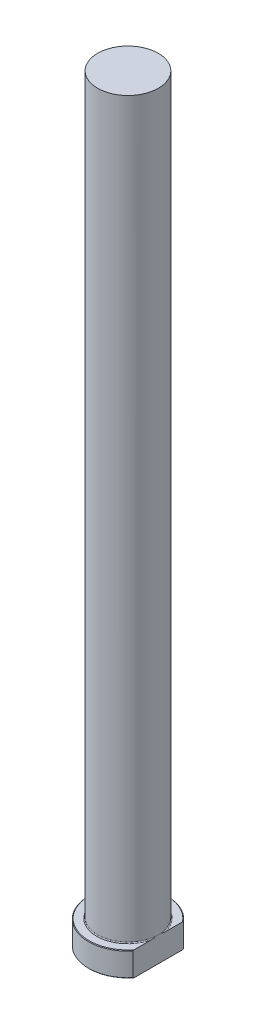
from build123d import *
from build123d.topology import SkipClean

# Parameters (mm, degrees)
CHAMFER1_SIZE = 0.2
FILLET1_R     = 0.3
KEY_DEPTH     = 251.675088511


with BuildPart() as part:
    # Sketch1 → Revolve1 (revolve)
    with BuildSketch(Plane.XY, mode=Mode.PRIVATE) as revolve1_sk:
        Polygon((0, 0), (-13, 0), (-13, 8), (-10, 8), (-10, 250), (0, 250), align=None)
    revolve(revolve1_sk.sketch.rotate(Axis((0, 259.958771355, 0), (0, -1, 0)), 270), axis=Axis((0, 259.958771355, 0), (0, -1, 0)))

    # Chamfer1
    chamfer1_edges = [part.edges().sort_by_distance(p)[0] for p in [
        (0, 8, -13),
        (0, 0, -13),
    ]]
    chamfer(chamfer1_edges, length=CHAMFER1_SIZE)

    # Fillet1
    fillet1_edges = [part.edges().sort_by_distance(p)[0] for p in [
        (0, 8, -10),
    ]]
    fillet(fillet1_edges, radius=FILLET1_R)

    # Sketch2 → KEY (cut, through all)
    with SkipClean():  # the faces are left unmerged after this step: merging them gives an invalid solid
        with BuildSketch(Plane(origin=(0, 0, 0), x_dir=(1, 0, 0), z_dir=(0, 1, 0))):
            with BuildLine():
                Line((10, 8.306623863), (10, -8.306623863))
                ThreePointArc((10, -8.306623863), (13, 0), (10, 8.306623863))
            make_face()
        extrude(amount=KEY_DEPTH, mode=Mode.SUBTRACT)


solid = part.part
